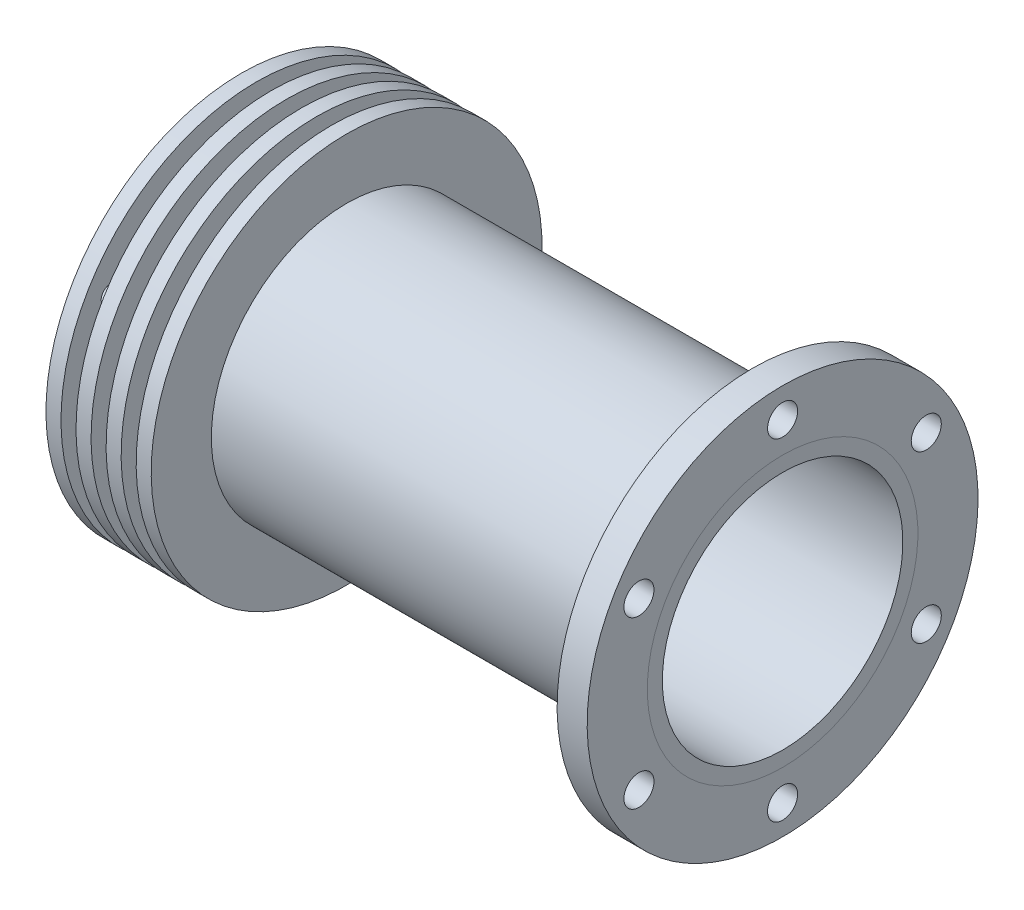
from build123d import *

# Parameters (mm, degrees)
SKETCH3_R          = 12.7
CUT_EXTRUDE3_DEPTH = 138.886776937
SKETCH5_R          = 25.4
CUT_EXTRUDE4_DEPTH = 138.886765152
SKETCH7_R          = 3.175
CUT_EXTRUDE5_DEPTH = 6.35
CIRPATTERN1_COUNT  = 6
SKETCH8_R          = 1.9812
CUT_EXTRUDE6_DEPTH = 6.604
CIRPATTERN2_COUNT  = 6


with BuildPart() as part:
    # Sketch1 → Revolve7 (revolve)
    with BuildSketch(Plane.XY):
        Polygon((18.042846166, -23.875960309), (18.042846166, 17.399039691), (21.217846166, 17.399039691), (21.217846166, 4.699039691), (24.392846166, 4.699039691), (24.392846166, 17.399039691), (27.567846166, 17.399039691), (27.567846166, 4.699039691), (30.742846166, 4.699039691), (30.742846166, 17.399039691), (33.917846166, 17.399039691), (33.917846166, 4.699039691), (37.092846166, 4.699039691), (37.092846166, 17.399039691), (40.267846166, 17.399039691), (40.267846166, 4.699039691), (125.992814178, 4.699039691), (125.992814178, 17.399039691), (132.342814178, 17.399039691), (132.342814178, 4.699039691), (132.342846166, -23.875960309), align=None)
    revolve(axis=Axis((132.342846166, -23.875960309, 0), (-1, 0, 0)))

    # Sketch3 → Cut-Extrude3 (cut, through all)
    with BuildSketch(Plane.ZY.offset(-18.042846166)):
        with Locations(Location((0, -23.875960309, 0), (0, 0, 270))):
            Circle(SKETCH3_R)
    extrude(amount=-CUT_EXTRUDE3_DEPTH, mode=Mode.SUBTRACT)

    # Sketch5 → Cut-Extrude4 (cut, through all)
    with BuildSketch(Plane.ZY.offset(-18.042846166)):
        with Locations(Location((0, -23.875960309, 0), (0, 0, 270))):
            Circle(SKETCH5_R)
    extrude(amount=-CUT_EXTRUDE4_DEPTH, mode=Mode.SUBTRACT)

    # Sketch7 → Cut-Extrude5 (cut)
    with BuildSketch(Plane(origin=(132.342814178, 0, 0), x_dir=(0, 0, -1), z_dir=(1, 0, 0))):
        with Locations(Location((0, 11.158990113, 0), (0, 0, 90))):
            Circle(SKETCH7_R)
    cut_extrude5 = extrude(amount=-CUT_EXTRUDE5_DEPTH, mode=Mode.SUBTRACT)

    # CirPattern1: Cut-Extrude5 ×6 about axis
    cirpattern1_axis = Axis((0, -23.875960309, 0), (1, 0, 0))
    for i in range(1, CIRPATTERN1_COUNT):
        add(cut_extrude5.rotate(cirpattern1_axis, i * 360 / CIRPATTERN1_COUNT), mode=Mode.SUBTRACT)

    # Sketch8 → Cut-Extrude6 (cut)
    with BuildSketch(Plane.ZY.offset(-18.042846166)):
        with Locations(Location((0, 11.694443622, 0), (0, 0, 270))):
            Circle(SKETCH8_R)
    cut_extrude6 = extrude(amount=-CUT_EXTRUDE6_DEPTH, mode=Mode.SUBTRACT)

    # CirPattern2: Cut-Extrude6 ×6 about axis
    cirpattern2_axis = Axis((0, -23.875960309, 0), (1, 0, 0))
    for i in range(1, CIRPATTERN2_COUNT):
        add(cut_extrude6.rotate(cirpattern2_axis, i * 360 / CIRPATTERN2_COUNT), mode=Mode.SUBTRACT)


solid = part.part
